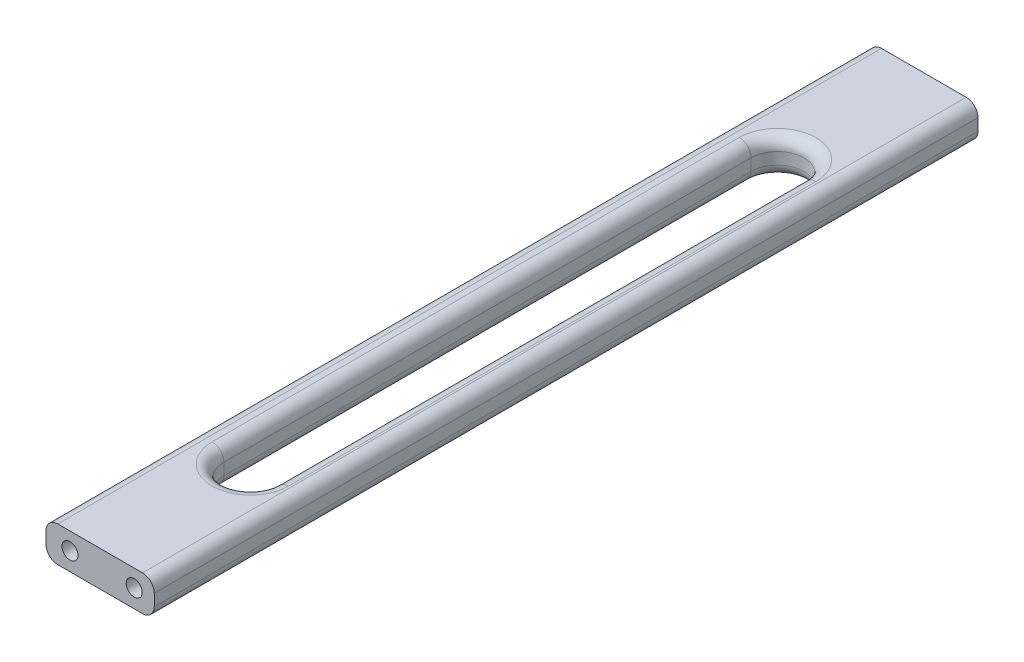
from build123d import *

# Parameters (mm, degrees)
BASE_EXTRUDE_DEPTH = 177.8
SKETCH5_R          = 1.7272
CUT_EXTRUDE1_DEPTH = 15.875
CUT_EXTRUDE2_START = -15.875
SKETCH6_R          = 1.7272
CUT_EXTRUDE2_DEPTH = 15.875
FILLET1_R          = 2.54
CUT_EXTRUDE4_DEPTH = 17.78
FILLET4_R          = 2.54


with BuildPart() as part:
    # Sketch3 → Base-Extrude (new body)
    with BuildSketch(Plane.XY):
        Polygon((0.322993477, -28.90336089), (9.552918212, -28.90336089), (11.264459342, -28.90336089), (11.264459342, -36.52336089), (-12.103540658, -36.52336089), (-12.103540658, -28.90336089), (-9.837006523, -28.90336089), align=None)
    extrude(amount=BASE_EXTRUDE_DEPTH)

    # Sketch5 → Cut-Extrude1 (cut)
    with BuildSketch(Plane.XY.offset(177.8)):
        with Locations((6.931255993, -32.608995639)):
            Circle(SKETCH5_R)
        with Locations(Location((-6.931255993, -32.608995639, 0), (0, 0, 180))):
            Circle(SKETCH5_R)
    extrude(amount=-CUT_EXTRUDE1_DEPTH, mode=Mode.SUBTRACT)

    # Sketch6 → Cut-Extrude2 (cut)
    with BuildSketch(Plane(origin=(0, 0, 0), x_dir=(-1, 0, 0), z_dir=(0, 0, -1)).offset(CUT_EXTRUDE2_START)):
        with Locations(Location((-6.931255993, -32.608995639, 0), (0, 0, 180))):
            Circle(SKETCH6_R)
        with Locations((6.931255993, -32.608995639)):
            Circle(SKETCH6_R)
    extrude(amount=CUT_EXTRUDE2_DEPTH, mode=Mode.SUBTRACT)

    # Fillet1
    fillet1_edges = [part.edges().sort_by_distance(p)[0] for p in [
        (-12.103540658, -28.90336089, 88.9),
        (11.264459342, -28.90336089, 88.9),
        (-12.103540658, -36.52336089, 88.9),
        (11.264459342, -36.52336089, 88.9),
    ]]
    fillet(fillet1_edges, radius=FILLET1_R)

    # Sketch7 → Cut-Extrude4 (cut, symmetric)
    with BuildSketch(Plane.XZ.offset(36.52336089)):
        with BuildLine():
            Line((5.715, 145.796), (5.715, 32.004))
            ThreePointArc((5.715, 32.004), (0, 26.289), (-5.715, 32.004))
            Line((-5.715, 32.004), (-5.715, 145.796))
            ThreePointArc((-5.715, 145.796), (0, 151.511), (5.715, 145.796))
        make_face()
    extrude(amount=CUT_EXTRUDE4_DEPTH, both=True, mode=Mode.SUBTRACT)

    # Fillet4
    fillet4_edges = [part.edges().sort_by_distance(p)[0] for p in [
        (5.715, -28.90336089, 88.9),
        (0, -28.90336089, 26.289),
        (-5.715, -28.90336089, 88.9),
        (0, -28.90336089, 151.511),
        (5.715, -36.52336089, 88.9),
        (0, -36.52336089, 26.289),
        (-5.715, -36.52336089, 88.9),
        (0, -36.52336089, 151.511),
    ]]
    fillet(fillet4_edges, radius=FILLET4_R)


solid = part.part
